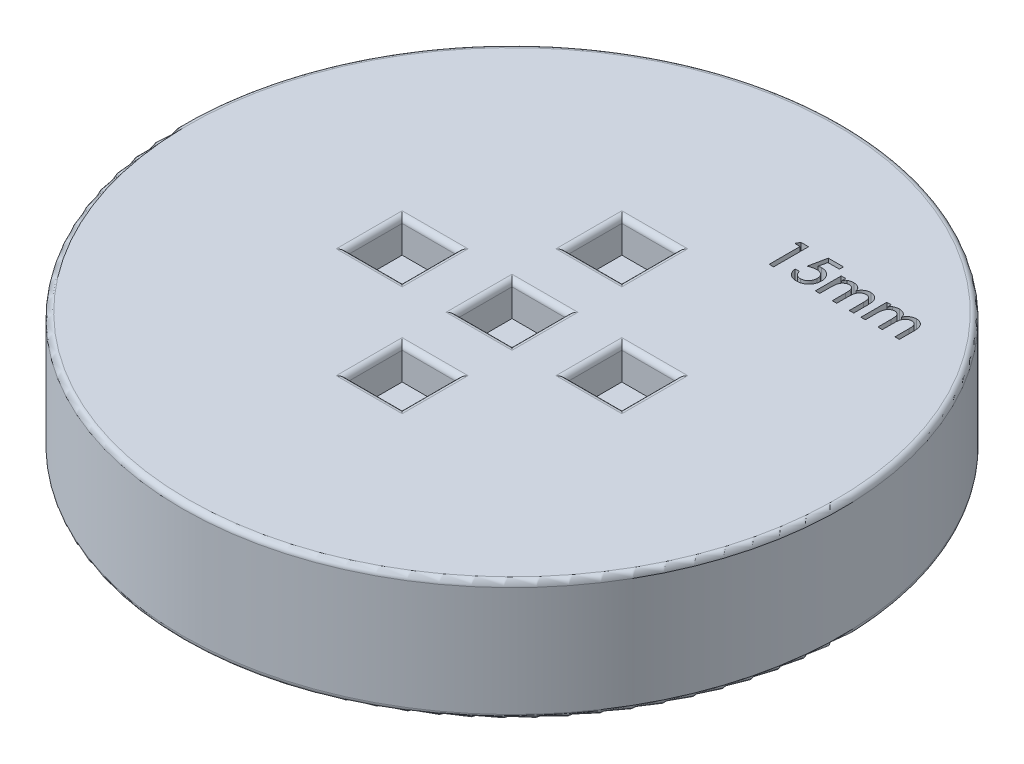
from build123d import *

# Parameters (mm, degrees)
SKETCH1_R           = 30
BOSS_EXTRUDE1_DEPTH = 11
SKETCH2_W           = 5
SKETCH2_H           = 5
CUT_EXTRUDE1_DEPTH  = 3
FILLET1_R           = 0.5
SKETCH4_W           = 5
SKETCH4_H           = 5
CUT_EXTRUDE2_DEPTH  = 3
FILLET2_R           = 0.5
FILLET3_R           = 0.5
CUT_EXTRUDE3_DEPTH  = 2


with BuildPart() as part:
    # Sketch1 → Boss-Extrude1 (new body)
    with BuildSketch(Plane(origin=(0, 0, 0), x_dir=(1, 0, 0), z_dir=(0, 1, 0))):
        with Locations(Location((0, 0, 0), (0, 0, 270))):
            Circle(SKETCH1_R)
    extrude(amount=BOSS_EXTRUDE1_DEPTH)

    # Sketch2 → Cut-Extrude1 (cut)
    with BuildSketch(Plane(origin=(0, 11, 0), x_dir=(1, 0, 0), z_dir=(0, 1, 0))):
        with Locations((0, -10)):
            Rectangle(SKETCH2_W, SKETCH2_H)
        with Locations((-10, 0)):
            Rectangle(SKETCH2_W, SKETCH2_H)
        Rectangle(SKETCH2_W, SKETCH2_H)
        with Locations((0, 10)):
            Rectangle(SKETCH2_W, SKETCH2_H)
        with Locations((10, 0)):
            Rectangle(SKETCH2_W, SKETCH2_H)
    extrude(amount=-CUT_EXTRUDE1_DEPTH, mode=Mode.SUBTRACT)

    # Fillet1
    fillet1_edges = [part.edges().sort_by_distance(p)[0] for p in [
        (2.5, 11, 0),
        (0, 11, 2.5),
        (-12.5, 11, 0),
        (-10, 11, 2.5),
        (-7.5, 11, 0),
        (-10, 11, -2.5),
    ]]
    fillet(fillet1_edges, radius=FILLET1_R)

    # Sketch4 → Cut-Extrude2 (cut)
    with BuildSketch(Plane(origin=(0, 0, 0), x_dir=(-1, 0, 0), z_dir=(0, -1, 0))):
        Rectangle(SKETCH4_W, SKETCH4_H)
        with Locations((0, -10)):
            Rectangle(SKETCH4_W, SKETCH4_H)
        with Locations((10, 0)):
            Rectangle(SKETCH4_W, SKETCH4_H)
        with Locations((-10, 0)):
            Rectangle(SKETCH4_W, SKETCH4_H)
        with Locations((0, 10)):
            Rectangle(SKETCH4_W, SKETCH4_H)
    extrude(amount=-CUT_EXTRUDE2_DEPTH, mode=Mode.SUBTRACT)

    # Fillet2
    fillet2_edges = [part.edges().sort_by_distance(p)[0] for p in [
        (-2.5, 0, 0),
        (0, 0, -2.5),
        (2.5, 0, 0),
        (0, 0, 2.5),
        (-2.5, 0, 10),
        (0, 0, 7.5),
        (2.5, 0, 10),
        (0, 0, 12.5),
        (-12.5, 0, 0),
        (-10, 0, -2.5),
        (-7.5, 0, 0),
        (-10, 0, 2.5),
        (7.5, 0, 0),
        (10, 0, -2.5),
        (12.5, 0, 0),
        (10, 0, 2.5),
        (2.5, 0, -10),
        (0, 0, -7.5),
        (-2.5, 0, -10),
        (0, 0, -12.5),
        (0, 0, -30),
    ]]
    fillet(fillet2_edges, radius=FILLET2_R)

    # Fillet3
    fillet3_edges = [part.edges().sort_by_distance(p)[0] for p in [
        (0, 11, -30),
        (0, 11, 7.5),
        (-2.5, 11, 10),
        (0, 11, 12.5),
        (2.5, 11, 10),
        (-2.5, 11, 0.25),
        (0.25, 11, -2.5),
        (0, 11, -12.5),
        (-2.5, 11, -10),
        (0, 11, -7.5),
        (2.5, 11, -10),
        (10, 11, 2.5),
        (12.5, 11, 0),
        (10, 11, -2.5),
        (7.5, 11, 0),
    ]]
    fillet(fillet3_edges, radius=FILLET3_R)

    # Sketch5 → Cut-Extrude3 (cut)
    with BuildSketch(Plane(origin=(0, 11, 0), x_dir=(1, 0, 0), z_dir=(0, 1, 0))):
        Polygon((7.644023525, 18.661400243), (8.334738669, 18.661400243), (8.334738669, 15.486400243), (7.927687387, 15.486400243), (7.927687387, 18.295054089), (7.439225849, 18.295054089), align=None)
        with BuildLine():
            Line((11.509738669, 18.661400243), (11.509738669, 18.295054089))
            Line((11.509738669, 18.295054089), (10.466669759, 18.295054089))
            Line((10.466669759, 18.295054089), (10.296217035, 17.542645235))
            add(Edge.make_bspline(
                [(10.296217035, 17.542645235), (10.316102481, 17.552228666), (10.357026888, 17.571951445), (10.425446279, 17.589135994), (10.499730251, 17.601227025), (10.551626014, 17.602437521), (10.578608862, 17.603066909)],
                knots=[0, 0, 0, 0, 0.906577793, 1.865744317, 2.890308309, 4, 4, 4, 4], degree=3))
            add(Edge.make_bspline(
                [(10.578608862, 17.603066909), (10.616824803, 17.602367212), (10.691855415, 17.600993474), (10.80120652, 17.585642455), (10.905407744, 17.562644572), (11.003601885, 17.528336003), (11.096910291, 17.486100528), (11.184320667, 17.433248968), (11.265742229, 17.370677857), (11.341066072, 17.29945262), (11.409717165, 17.22187125), (11.468679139, 17.138090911), (11.519789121, 17.050559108), (11.560301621, 16.957763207), (11.59231069, 16.860663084), (11.615074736, 16.758852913), (11.629546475, 16.652637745), (11.631077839, 16.580185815), (11.631854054, 16.543461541)],
                knots=[0, 0, 0, 0, 1.094894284, 2.149641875, 3.159658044, 4.149576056, 5.125966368, 6.091225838, 7.071072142, 8.064343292, 9.05924964, 10.03573454, 10.996966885, 11.96032995, 12.932910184, 13.923798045, 14.947619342, 16, 16, 16, 16], degree=3))
            add(Edge.make_bspline(
                [(11.631854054, 16.543461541), (11.631257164, 16.517799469), (11.630076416, 16.467035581), (11.623923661, 16.391552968), (11.612179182, 16.317698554), (11.596585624, 16.244901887), (11.575098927, 16.173787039), (11.550639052, 16.103408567), (11.520588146, 16.034888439), (11.486280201, 15.968255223), (11.44821581, 15.903996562), (11.406305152, 15.842891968), (11.360452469, 15.785429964), (11.31049506, 15.732091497), (11.2577985, 15.681504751), (11.200988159, 15.634989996), (11.140225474, 15.59235186), (11.076377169, 15.553124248), (11.009473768, 15.51768508), (10.939122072, 15.488342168), (10.867068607, 15.461681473), (10.791531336, 15.44171878), (10.71393455, 15.424920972), (10.63334701, 15.413773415), (10.550333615, 15.406505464), (10.494034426, 15.40550094), (10.465397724, 15.404989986)],
                knots=[0, 0, 0, 0, 1.012275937, 2.002451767, 2.98397589, 3.959820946, 4.936095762, 5.911940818, 6.896771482, 7.884012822, 8.866284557, 9.840372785, 10.804070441, 11.762530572, 12.720625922, 13.68308951, 14.655094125, 15.646011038, 16.637104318, 17.63729087, 18.650257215, 19.66446511, 20.715636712, 21.77986274, 22.870722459, 24, 24, 24, 24], degree=3))
            add(Edge.make_bspline(
                [(10.465397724, 15.404989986), (10.433144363, 15.405764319), (10.369515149, 15.407291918), (10.276062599, 15.418126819), (10.186410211, 15.436510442), (10.100937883, 15.46282638), (10.019009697, 15.495833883), (9.941324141, 15.536666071), (9.86757933, 15.584956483), (9.797680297, 15.639784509), (9.733929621, 15.702328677), (9.675165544, 15.769659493), (9.625098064, 15.8442559), (9.581053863, 15.924059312), (9.543210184, 16.009718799), (9.513103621, 16.101396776), (9.489029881, 16.198746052), (9.479407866, 16.266049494), (9.474482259, 16.300502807)],
                knots=[0, 0, 0, 0, 1.049569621, 2.070583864, 3.057046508, 4.023914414, 4.977170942, 5.927726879, 6.875021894, 7.842677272, 8.813672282, 9.777581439, 10.74592533, 11.731059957, 12.74126976, 13.788569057, 14.867946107, 16, 16, 16, 16], degree=3))
            Line((9.474482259, 16.300502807), (9.871993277, 16.300502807))
            add(Edge.make_bspline(
                [(9.871993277, 16.300502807), (9.879558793, 16.267229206), (9.893761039, 16.204766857), (9.924271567, 16.119657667), (9.956972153, 16.047271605), (9.996967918, 15.988072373), (10.042872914, 15.939478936), (10.093824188, 15.897298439), (10.149800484, 15.85946159), (10.211424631, 15.828053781), (10.276352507, 15.802608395), (10.343814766, 15.784849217), (10.41244898, 15.773682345), (10.458784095, 15.772117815), (10.481934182, 15.77133614)],
                knots=[0, 0, 0, 0, 1.385459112, 2.600831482, 3.66841355, 4.605180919, 5.48910649, 6.376050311, 7.288896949, 8.229144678, 9.181161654, 10.117453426, 11.059436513, 12, 12, 12, 12], degree=3))
            add(Edge.make_bspline(
                [(10.481934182, 15.77133614), (10.506977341, 15.772176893), (10.556420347, 15.773836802), (10.629257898, 15.783773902), (10.698917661, 15.80215488), (10.766405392, 15.82597995), (10.830542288, 15.858430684), (10.892902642, 15.896321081), (10.951212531, 15.942849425), (11.007101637, 15.994583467), (11.058290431, 16.051887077), (11.102863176, 16.113801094), (11.140885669, 16.179082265), (11.17118632, 16.248164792), (11.195777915, 16.320415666), (11.212681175, 16.396328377), (11.223227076, 16.47574435), (11.22427063, 16.529859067), (11.224802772, 16.557453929)],
                knots=[0, 0, 0, 0, 0.99750234, 1.969380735, 2.919490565, 3.862219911, 4.813679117, 5.776605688, 6.762898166, 7.778387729, 8.806918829, 9.816812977, 10.811632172, 11.809420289, 12.815921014, 13.846113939, 14.901663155, 16, 16, 16, 16], degree=3))
            add(Edge.make_bspline(
                [(11.224802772, 16.557453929), (11.22417004, 16.582074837), (11.222927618, 16.630420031), (11.213826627, 16.701078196), (11.199390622, 16.768477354), (11.178413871, 16.831983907), (11.151449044, 16.891949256), (11.118290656, 16.947989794), (11.079039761, 17.000417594), (11.034898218, 17.049402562), (10.984929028, 17.093170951), (10.931276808, 17.132342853), (10.872312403, 17.16402408), (10.810162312, 17.191135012), (10.743388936, 17.210948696), (10.673188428, 17.226914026), (10.598281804, 17.234584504), (10.547032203, 17.235996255), (10.520731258, 17.236720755)],
                knots=[0, 0, 0, 0, 1.071512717, 2.104004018, 3.095982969, 4.067795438, 5.009520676, 5.952827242, 6.895998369, 7.856350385, 8.817411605, 9.782937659, 10.74115891, 11.725120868, 12.729302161, 13.768330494, 14.854722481, 16, 16, 16, 16], degree=3))
            add(Edge.make_bspline(
                [(10.520731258, 17.236720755), (10.498240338, 17.236181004), (10.451022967, 17.235047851), (10.377136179, 17.226854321), (10.296732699, 17.213967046), (10.209939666, 17.196143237), (10.116673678, 17.172922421), (10.016821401, 17.144784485), (9.910272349, 17.111950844), (9.837576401, 17.086838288), (9.800123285, 17.073900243)],
                knots=[0, 0, 0, 0, 0.727614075, 1.527550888, 2.402655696, 3.361819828, 4.39328773, 5.511706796, 6.718025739, 8, 8, 8, 8], degree=3))
            Line((9.800123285, 17.073900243), (10.133396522, 18.661400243))
            Line((10.133396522, 18.661400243), (11.509738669, 18.661400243))
        make_face()
        with BuildLine():
            Line((12.120315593, 17.847297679), (12.527366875, 17.847297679))
            Line((12.527366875, 17.847297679), (12.527366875, 17.451058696))
            add(Edge.make_bspline(
                [(12.527366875, 17.451058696), (12.531276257, 17.468109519), (12.538904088, 17.501378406), (12.555700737, 17.548854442), (12.576220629, 17.592755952), (12.599575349, 17.634131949), (12.627955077, 17.671377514), (12.658998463, 17.706377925), (12.694938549, 17.736787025), (12.720976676, 17.75445647), (12.734072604, 17.763343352)],
                knots=[0, 0, 0, 0, 1.08898891, 2.124791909, 3.129224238, 4.105481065, 5.077441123, 6.040388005, 7.014409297, 8, 8, 8, 8], degree=3))
            add(Edge.make_bspline(
                [(12.734072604, 17.763343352), (12.773491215, 17.782653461), (12.851321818, 17.820780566), (12.974418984, 17.858653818), (13.098958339, 17.883887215), (13.182976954, 17.886628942), (13.225078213, 17.888002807)],
                knots=[0, 0, 0, 0, 1.028471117, 2.030678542, 3.013184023, 4, 4, 4, 4], degree=3))
            add(Edge.make_bspline(
                [(13.225078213, 17.888002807), (13.256085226, 17.887213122), (13.317574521, 17.885647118), (13.408621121, 17.871047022), (13.497046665, 17.847578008), (13.582017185, 17.8151873), (13.661285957, 17.775444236), (13.733660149, 17.730536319), (13.797366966, 17.679626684), (13.853225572, 17.623884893), (13.899640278, 17.561390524), (13.936241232, 17.492958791), (13.962206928, 17.417736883), (13.971042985, 17.364947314), (13.975579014, 17.337847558)],
                knots=[0, 0, 0, 0, 1.099015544, 2.179432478, 3.260947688, 4.338981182, 5.398181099, 6.40160478, 7.353922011, 8.284349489, 9.192639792, 10.104191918, 11.026778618, 12, 12, 12, 12], degree=3))
            add(Edge.make_bspline(
                [(13.975579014, 17.337847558), (13.982925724, 17.358731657), (13.997453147, 17.400027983), (14.024018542, 17.459522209), (14.05619878, 17.5150528), (14.092590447, 17.567361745), (14.133202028, 17.616771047), (14.179481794, 17.661560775), (14.229058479, 17.704230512), (14.283729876, 17.741634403), (14.340597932, 17.775946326), (14.399275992, 17.805858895), (14.458880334, 17.831494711), (14.51989128, 17.851638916), (14.581525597, 17.868593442), (14.644735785, 17.879997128), (14.708994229, 17.88620602), (14.752144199, 17.887402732), (14.773781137, 17.888002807)],
                knots=[0, 0, 0, 0, 1.024672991, 2.026193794, 3.01103273, 3.991165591, 4.973850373, 5.96628909, 6.969107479, 7.9982829, 9.028393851, 10.042340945, 11.044967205, 12.028827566, 13.014448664, 14.002022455, 14.998142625, 16, 16, 16, 16], degree=3))
            add(Edge.make_bspline(
                [(14.773781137, 17.888002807), (14.795848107, 17.887713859), (14.839230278, 17.887145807), (14.90314841, 17.880346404), (14.965058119, 17.870436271), (15.02486519, 17.855878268), (15.082353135, 17.83654174), (15.137797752, 17.81357135), (15.191472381, 17.787103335), (15.258578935, 17.745353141), (15.33680706, 17.687094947), (15.416181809, 17.602984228), (15.482706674, 17.509265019), (15.525929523, 17.42193515), (15.553467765, 17.345298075), (15.571970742, 17.280969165), (15.586840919, 17.210117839), (15.599710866, 17.133127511), (15.608937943, 17.049448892), (15.61576761, 16.959505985), (15.62047743, 16.863003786), (15.620793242, 16.796602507), (15.620956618, 16.762251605)],
                knots=[0, 0, 0, 0, 0.823429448, 1.618806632, 2.396867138, 3.162757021, 3.913573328, 4.658737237, 5.40200746, 6.144476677, 7.607081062, 9.028926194, 10.443018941, 11.88355177, 12.649646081, 13.481287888, 14.380074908, 15.350698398, 16.394246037, 17.521443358, 18.717785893, 20, 20, 20, 20], degree=3))
            Line((15.620956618, 16.762251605), (15.620956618, 15.486400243))
            Line((15.620956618, 15.486400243), (15.213905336, 15.486400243))
            Line((15.213905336, 15.486400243), (15.213905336, 16.76097957))
            add(Edge.make_bspline(
                [(15.213905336, 16.76097957), (15.213854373, 16.789390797), (15.213756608, 16.843894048), (15.211069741, 16.921927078), (15.20729563, 16.992752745), (15.202536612, 17.05643718), (15.195503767, 17.11307325), (15.1872964, 17.162729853), (15.178344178, 17.205452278), (15.162922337, 17.252156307), (15.13882698, 17.303207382), (15.101186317, 17.357731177), (15.054920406, 17.40572481), (15.000621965, 17.446960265), (14.939689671, 17.481170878), (14.871736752, 17.504243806), (14.798646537, 17.519687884), (14.74778919, 17.520987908), (14.721627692, 17.521656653)],
                knots=[0, 0, 0, 0, 1.305376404, 2.504195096, 3.587062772, 4.564309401, 5.437885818, 6.208191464, 6.877018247, 7.440755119, 8.464755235, 9.459136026, 10.471907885, 11.51427718, 12.582498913, 13.666986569, 14.799875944, 16, 16, 16, 16], degree=3))
            add(Edge.make_bspline(
                [(14.721627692, 17.521656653), (14.692477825, 17.520235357), (14.634108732, 17.517389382), (14.547904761, 17.496555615), (14.465147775, 17.460540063), (14.385712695, 17.412523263), (14.312786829, 17.351458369), (14.248193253, 17.278874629), (14.194901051, 17.19401295), (14.157267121, 17.115137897), (14.132971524, 17.043017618), (14.117630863, 16.979077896), (14.103318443, 16.906595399), (14.09328581, 16.824929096), (14.08387924, 16.734435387), (14.078943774, 16.634874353), (14.074725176, 16.526325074), (14.074354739, 16.451032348), (14.074161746, 16.411805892)],
                knots=[0, 0, 0, 0, 0.96585306, 1.934004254, 2.919496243, 3.947541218, 5.000269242, 6.060662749, 7.154254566, 8.311133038, 8.948925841, 9.673294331, 10.489200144, 11.396606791, 12.399336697, 13.504450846, 14.699853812, 16, 16, 16, 16], degree=3))
            Line((14.074161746, 16.411805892), (14.074161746, 15.486400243))
            Line((14.074161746, 15.486400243), (13.667110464, 15.486400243))
            Line((13.667110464, 15.486400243), (13.667110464, 16.684021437))
            add(Edge.make_bspline(
                [(13.667110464, 16.684021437), (13.667060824, 16.716036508), (13.6669658, 16.777322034), (13.664271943, 16.865105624), (13.660484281, 16.944832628), (13.655793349, 17.016357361), (13.648759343, 17.079568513), (13.640476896, 17.134506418), (13.631657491, 17.181477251), (13.616264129, 17.232090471), (13.59273135, 17.287556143), (13.554949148, 17.346324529), (13.508384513, 17.398153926), (13.453437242, 17.441873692), (13.391856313, 17.4776804), (13.323987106, 17.503310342), (13.250595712, 17.518966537), (13.199717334, 17.520743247), (13.173560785, 17.521656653)],
                knots=[0, 0, 0, 0, 1.376972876, 2.63589934, 3.777064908, 4.810071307, 5.718390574, 6.511518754, 7.200035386, 7.771255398, 8.78422519, 9.780850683, 10.762300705, 11.767731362, 12.789080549, 13.813681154, 14.876014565, 16, 16, 16, 16], degree=3))
            add(Edge.make_bspline(
                [(13.173560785, 17.521656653), (13.145684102, 17.520186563), (13.089673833, 17.517232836), (13.006587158, 17.4969088), (12.925561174, 17.462124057), (12.846751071, 17.415547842), (12.772788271, 17.356715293), (12.707774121, 17.284836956), (12.652402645, 17.201356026), (12.614114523, 17.122947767), (12.588940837, 17.052547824), (12.572859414, 16.991810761), (12.557936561, 16.924436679), (12.54695029, 16.849801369), (12.538065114, 16.768332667), (12.531875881, 16.679859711), (12.528028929, 16.584413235), (12.527592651, 16.518448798), (12.527366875, 16.484311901)],
                knots=[0, 0, 0, 0, 0.973948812, 1.956873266, 2.969584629, 4.045778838, 5.147278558, 6.259119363, 7.418022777, 8.637370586, 9.298195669, 10.027900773, 10.831491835, 11.708502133, 12.662464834, 13.694928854, 14.807115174, 16, 16, 16, 16], degree=3))
            Line((12.527366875, 16.484311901), (12.527366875, 15.486400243))
            Line((12.527366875, 15.486400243), (12.120315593, 15.486400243))
            Line((12.120315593, 15.486400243), (12.120315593, 17.847297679))
        make_face()
        with BuildLine():
            Line((16.272238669, 17.847297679), (16.679289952, 17.847297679))
            Line((16.679289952, 17.847297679), (16.679289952, 17.451058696))
            add(Edge.make_bspline(
                [(16.679289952, 17.451058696), (16.683199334, 17.468109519), (16.690827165, 17.501378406), (16.707623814, 17.548854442), (16.728143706, 17.592755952), (16.751498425, 17.634131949), (16.779878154, 17.671377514), (16.81092154, 17.706377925), (16.846861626, 17.736787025), (16.872899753, 17.75445647), (16.885995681, 17.763343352)],
                knots=[0, 0, 0, 0, 1.08898891, 2.124791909, 3.129224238, 4.105481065, 5.077441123, 6.040388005, 7.014409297, 8, 8, 8, 8], degree=3))
            add(Edge.make_bspline(
                [(16.885995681, 17.763343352), (16.925414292, 17.782653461), (17.003244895, 17.820780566), (17.126342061, 17.858653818), (17.250881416, 17.883887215), (17.334900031, 17.886628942), (17.37700129, 17.888002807)],
                knots=[0, 0, 0, 0, 1.028471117, 2.030678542, 3.013184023, 4, 4, 4, 4], degree=3))
            add(Edge.make_bspline(
                [(17.37700129, 17.888002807), (17.408008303, 17.887213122), (17.469497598, 17.885647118), (17.560544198, 17.871047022), (17.648969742, 17.847578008), (17.733940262, 17.8151873), (17.813209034, 17.775444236), (17.885583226, 17.730536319), (17.949290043, 17.679626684), (18.005148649, 17.623884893), (18.051563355, 17.561390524), (18.088164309, 17.492958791), (18.114130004, 17.417736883), (18.122966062, 17.364947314), (18.127502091, 17.337847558)],
                knots=[0, 0, 0, 0, 1.099015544, 2.179432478, 3.260947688, 4.338981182, 5.398181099, 6.40160478, 7.353922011, 8.284349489, 9.192639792, 10.104191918, 11.026778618, 12, 12, 12, 12], degree=3))
            add(Edge.make_bspline(
                [(18.127502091, 17.337847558), (18.134848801, 17.358731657), (18.149376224, 17.400027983), (18.175941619, 17.459522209), (18.208121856, 17.5150528), (18.244513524, 17.567361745), (18.285125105, 17.616771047), (18.331404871, 17.661560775), (18.380981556, 17.704230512), (18.435652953, 17.741634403), (18.492521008, 17.775946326), (18.551199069, 17.805858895), (18.610803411, 17.831494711), (18.671814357, 17.851638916), (18.733448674, 17.868593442), (18.796658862, 17.879997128), (18.860917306, 17.88620602), (18.904067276, 17.887402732), (18.925704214, 17.888002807)],
                knots=[0, 0, 0, 0, 1.024672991, 2.026193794, 3.01103273, 3.991165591, 4.973850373, 5.96628909, 6.969107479, 7.9982829, 9.028393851, 10.042340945, 11.044967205, 12.028827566, 13.014448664, 14.002022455, 14.998142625, 16, 16, 16, 16], degree=3))
            add(Edge.make_bspline(
                [(18.925704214, 17.888002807), (18.947771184, 17.887713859), (18.991153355, 17.887145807), (19.055071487, 17.880346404), (19.116981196, 17.870436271), (19.176788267, 17.855878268), (19.234276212, 17.83654174), (19.289720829, 17.81357135), (19.343395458, 17.787103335), (19.410502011, 17.745353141), (19.488730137, 17.687094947), (19.568104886, 17.602984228), (19.634629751, 17.509265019), (19.6778526, 17.42193515), (19.705390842, 17.345298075), (19.723893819, 17.280969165), (19.738763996, 17.210117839), (19.751633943, 17.133127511), (19.76086102, 17.049448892), (19.767690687, 16.959505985), (19.772400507, 16.863003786), (19.772716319, 16.796602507), (19.772879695, 16.762251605)],
                knots=[0, 0, 0, 0, 0.823429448, 1.618806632, 2.396867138, 3.162757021, 3.913573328, 4.658737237, 5.40200746, 6.144476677, 7.607081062, 9.028926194, 10.443018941, 11.88355177, 12.649646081, 13.481287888, 14.380074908, 15.350698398, 16.394246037, 17.521443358, 18.717785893, 20, 20, 20, 20], degree=3))
            Line((19.772879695, 16.762251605), (19.772879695, 15.486400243))
            Line((19.772879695, 15.486400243), (19.365828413, 15.486400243))
            Line((19.365828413, 15.486400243), (19.365828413, 16.76097957))
            add(Edge.make_bspline(
                [(19.365828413, 16.76097957), (19.36577745, 16.789390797), (19.365679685, 16.843894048), (19.362992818, 16.921927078), (19.359218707, 16.992752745), (19.354459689, 17.05643718), (19.347426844, 17.11307325), (19.339219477, 17.162729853), (19.330267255, 17.205452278), (19.314845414, 17.252156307), (19.290750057, 17.303207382), (19.253109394, 17.357731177), (19.206843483, 17.40572481), (19.152545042, 17.446960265), (19.091612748, 17.481170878), (19.023659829, 17.504243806), (18.950569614, 17.519687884), (18.899712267, 17.520987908), (18.873550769, 17.521656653)],
                knots=[0, 0, 0, 0, 1.305376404, 2.504195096, 3.587062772, 4.564309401, 5.437885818, 6.208191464, 6.877018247, 7.440755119, 8.464755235, 9.459136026, 10.471907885, 11.51427718, 12.582498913, 13.666986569, 14.799875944, 16, 16, 16, 16], degree=3))
            add(Edge.make_bspline(
                [(18.873550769, 17.521656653), (18.844400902, 17.520235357), (18.786031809, 17.517389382), (18.699827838, 17.496555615), (18.617070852, 17.460540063), (18.537635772, 17.412523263), (18.464709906, 17.351458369), (18.40011633, 17.278874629), (18.346824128, 17.19401295), (18.309190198, 17.115137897), (18.284894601, 17.043017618), (18.26955394, 16.979077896), (18.25524152, 16.906595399), (18.245208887, 16.824929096), (18.235802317, 16.734435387), (18.230866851, 16.634874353), (18.226648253, 16.526325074), (18.226277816, 16.451032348), (18.226084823, 16.411805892)],
                knots=[0, 0, 0, 0, 0.96585306, 1.934004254, 2.919496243, 3.947541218, 5.000269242, 6.060662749, 7.154254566, 8.311133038, 8.948925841, 9.673294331, 10.489200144, 11.396606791, 12.399336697, 13.504450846, 14.699853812, 16, 16, 16, 16], degree=3))
            Line((18.226084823, 16.411805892), (18.226084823, 15.486400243))
            Line((18.226084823, 15.486400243), (17.819033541, 15.486400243))
            Line((17.819033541, 15.486400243), (17.819033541, 16.684021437))
            add(Edge.make_bspline(
                [(17.819033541, 16.684021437), (17.818983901, 16.716036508), (17.818888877, 16.777322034), (17.81619502, 16.865105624), (17.812407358, 16.944832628), (17.807716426, 17.016357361), (17.80068242, 17.079568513), (17.792399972, 17.134506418), (17.783580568, 17.181477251), (17.768187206, 17.232090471), (17.744654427, 17.287556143), (17.706872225, 17.346324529), (17.66030759, 17.398153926), (17.605360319, 17.441873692), (17.54377939, 17.4776804), (17.475910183, 17.503310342), (17.402518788, 17.518966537), (17.351640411, 17.520743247), (17.325483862, 17.521656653)],
                knots=[0, 0, 0, 0, 1.376972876, 2.63589934, 3.777064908, 4.810071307, 5.718390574, 6.511518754, 7.200035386, 7.771255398, 8.78422519, 9.780850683, 10.762300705, 11.767731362, 12.789080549, 13.813681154, 14.876014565, 16, 16, 16, 16], degree=3))
            add(Edge.make_bspline(
                [(17.325483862, 17.521656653), (17.297607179, 17.520186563), (17.24159691, 17.517232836), (17.158510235, 17.4969088), (17.077484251, 17.462124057), (16.998674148, 17.415547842), (16.924711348, 17.356715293), (16.859697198, 17.284836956), (16.804325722, 17.201356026), (16.7660376, 17.122947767), (16.740863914, 17.052547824), (16.724782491, 16.991810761), (16.709859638, 16.924436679), (16.698873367, 16.849801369), (16.689988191, 16.768332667), (16.683798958, 16.679859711), (16.679952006, 16.584413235), (16.679515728, 16.518448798), (16.679289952, 16.484311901)],
                knots=[0, 0, 0, 0, 0.973948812, 1.956873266, 2.969584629, 4.045778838, 5.147278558, 6.259119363, 7.418022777, 8.637370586, 9.298195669, 10.027900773, 10.831491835, 11.708502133, 12.662464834, 13.694928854, 14.807115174, 16, 16, 16, 16], degree=3))
            Line((16.679289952, 16.484311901), (16.679289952, 15.486400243))
            Line((16.679289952, 15.486400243), (16.272238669, 15.486400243))
            Line((16.272238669, 15.486400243), (16.272238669, 17.847297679))
        make_face()
    extrude(amount=-CUT_EXTRUDE3_DEPTH, mode=Mode.SUBTRACT)


solid = part.part
